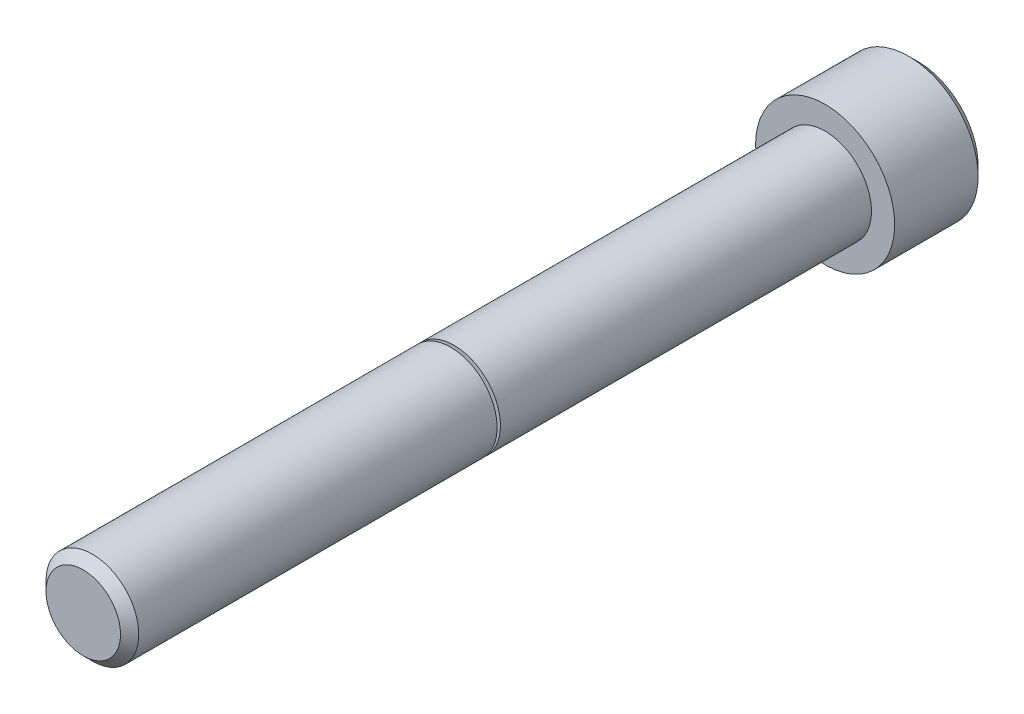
ISO-10303-21;
HEADER;
FILE_DESCRIPTION(('STEP AP214'),'2;1');
FILE_NAME('part.step','',(''),(''),'','','');
FILE_SCHEMA(('AUTOMOTIVE_DESIGN { 1 0 10303 214 1 1 1 1 }'));
ENDSEC;
DATA;
#1=APPLICATION_CONTEXT('core data for automotive mechanical design processes');
#2=APPLICATION_PROTOCOL_DEFINITION('international standard','automotive_design',2000,#1);
#3=PRODUCT_CONTEXT('',#1,'mechanical');
#4=PRODUCT('Part','Part','',(#3));
#5=PRODUCT_RELATED_PRODUCT_CATEGORY('part','',(#4));
#6=PRODUCT_DEFINITION_FORMATION('','',#4);
#7=PRODUCT_DEFINITION_CONTEXT('part definition',#1,'design');
#8=PRODUCT_DEFINITION('design','',#6,#7);
#9=PRODUCT_DEFINITION_SHAPE('','',#8);
#10=(LENGTH_UNIT() NAMED_UNIT(*) SI_UNIT(.MILLI.,.METRE.));
#11=(NAMED_UNIT(*) PLANE_ANGLE_UNIT() SI_UNIT($,.RADIAN.));
#12=(NAMED_UNIT(*) SI_UNIT($,.STERADIAN.) SOLID_ANGLE_UNIT());
#13=UNCERTAINTY_MEASURE_WITH_UNIT(LENGTH_MEASURE(1.E-05),#10,'distance_accuracy_value','');
#14=(GEOMETRIC_REPRESENTATION_CONTEXT(3) GLOBAL_UNCERTAINTY_ASSIGNED_CONTEXT((#13)) GLOBAL_UNIT_ASSIGNED_CONTEXT((#10,
#11,#12)) REPRESENTATION_CONTEXT('',''));
#15=CARTESIAN_POINT('',(0.,0.,0.));
#16=DIRECTION('',(0.,0.,1.));
#17=DIRECTION('',(1.,0.,0.));
#18=AXIS2_PLACEMENT_3D('',#15,#16,#17);
#19=CARTESIAN_POINT('',(0.,0.,-6.35));
#20=DIRECTION('',(0.,0.,1.));
#21=DIRECTION('',(1.,0.,0.));
#22=AXIS2_PLACEMENT_3D('',#19,#20,#21);
#23=PLANE('',#22);
#24=DIRECTION('',(-0.5,-0.866025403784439,0.));
#25=VECTOR('',#24,1.);
#26=CARTESIAN_POINT('',(2.74963065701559,0.,-6.35));
#27=LINE('',#26,#25);
#28=CARTESIAN_POINT('',(2.74963065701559,0.,-6.35));
#29=VERTEX_POINT('',#28);
#30=CARTESIAN_POINT('',(1.37481532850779,-2.38125000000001,-6.35));
#31=VERTEX_POINT('',#30);
#32=EDGE_CURVE('E145',#29,#31,#27,.T.);
#33=ORIENTED_EDGE('',*,*,#32,.F.);
#34=DIRECTION('',(0.499999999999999,-0.866025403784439,0.));
#35=VECTOR('',#34,1.);
#36=CARTESIAN_POINT('',(1.3748153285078,2.38125,-6.35));
#37=LINE('',#36,#35);
#38=CARTESIAN_POINT('',(1.3748153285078,2.38125,-6.35));
#39=VERTEX_POINT('',#38);
#40=EDGE_CURVE('E64',#39,#29,#37,.T.);
#41=ORIENTED_EDGE('',*,*,#40,.F.);
#42=DIRECTION('',(1.,0.,0.));
#43=VECTOR('',#42,1.);
#44=CARTESIAN_POINT('',(-1.3748153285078,2.38125,-6.35));
#45=LINE('',#44,#43);
#46=CARTESIAN_POINT('',(-1.3748153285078,2.38125,-6.35));
#47=VERTEX_POINT('',#46);
#48=EDGE_CURVE('E158',#47,#39,#45,.T.);
#49=ORIENTED_EDGE('',*,*,#48,.F.);
#50=DIRECTION('',(0.5,0.866025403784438,0.));
#51=VECTOR('',#50,1.);
#52=CARTESIAN_POINT('',(-2.74963065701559,0.,-6.35));
#53=LINE('',#52,#51);
#54=CARTESIAN_POINT('',(-2.74963065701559,0.,-6.35));
#55=VERTEX_POINT('',#54);
#56=EDGE_CURVE('E155',#55,#47,#53,.T.);
#57=ORIENTED_EDGE('',*,*,#56,.F.);
#58=DIRECTION('',(-0.5,0.866025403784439,0.));
#59=VECTOR('',#58,1.);
#60=CARTESIAN_POINT('',(-1.3748153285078,-2.38125000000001,-6.35));
#61=LINE('',#60,#59);
#62=CARTESIAN_POINT('',(-1.3748153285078,-2.38125000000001,-6.35));
#63=VERTEX_POINT('',#62);
#64=EDGE_CURVE('E112',#63,#55,#61,.T.);
#65=ORIENTED_EDGE('',*,*,#64,.F.);
#66=DIRECTION('',(-1.,0.,0.));
#67=VECTOR('',#66,1.);
#68=CARTESIAN_POINT('',(1.37481532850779,-2.38125000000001,-6.35));
#69=LINE('',#68,#67);
#70=EDGE_CURVE('E149',#31,#63,#69,.T.);
#71=ORIENTED_EDGE('',*,*,#70,.F.);
#72=EDGE_LOOP('',(#33,#41,#49,#57,#65,#71));
#73=FACE_BOUND('',#72,.T.);
#74=CARTESIAN_POINT('',(0.,0.,-6.35));
#75=DIRECTION('',(0.,0.,-1.));
#76=DIRECTION('',(-1.,0.,0.));
#77=AXIS2_PLACEMENT_3D('',#74,#75,#76);
#78=CIRCLE('',#77,4.1275);
#79=CARTESIAN_POINT('',(-4.1275,0.,-6.35));
#80=VERTEX_POINT('',#79);
#81=EDGE_CURVE('E164',#80,#80,#78,.T.);
#82=ORIENTED_EDGE('',*,*,#81,.T.);
#83=EDGE_LOOP('',(#82));
#84=FACE_BOUND('',#83,.T.);
#85=ADVANCED_FACE('F49',(#73,#84),#23,.F.);
#86=CARTESIAN_POINT('',(-2.55270000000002,0.,50.8));
#87=DIRECTION('',(0.,0.,-1.));
#88=DIRECTION('',(-1.,0.,0.));
#89=AXIS2_PLACEMENT_3D('',#86,#87,#88);
#90=PLANE('',#89);
#91=CARTESIAN_POINT('',(0.,0.,50.8));
#92=DIRECTION('',(0.,0.,-1.));
#93=DIRECTION('',(-1.,0.,0.));
#94=AXIS2_PLACEMENT_3D('',#91,#92,#93);
#95=CIRCLE('',#94,2.55270000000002);
#96=CARTESIAN_POINT('',(-2.55270000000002,0.,50.8));
#97=VERTEX_POINT('',#96);
#98=EDGE_CURVE('E11',#97,#97,#95,.T.);
#99=ORIENTED_EDGE('',*,*,#98,.F.);
#100=EDGE_LOOP('',(#99));
#101=FACE_BOUND('',#100,.T.);
#102=ADVANCED_FACE('F214',(#101),#90,.F.);
#103=CARTESIAN_POINT('',(0.,0.,50.8));
#104=DIRECTION('',(0.,0.,-1.));
#105=DIRECTION('',(-1.,0.,0.));
#106=AXIS2_PLACEMENT_3D('',#103,#104,#105);
#107=CONICAL_SURFACE('',#106,2.55270000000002,0.785398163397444);
#108=CARTESIAN_POINT('',(0.,0.,50.1777));
#109=DIRECTION('',(0.,0.,-1.));
#110=DIRECTION('',(-1.,0.,0.));
#111=AXIS2_PLACEMENT_3D('',#108,#109,#110);
#112=CIRCLE('',#111,3.17500000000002);
#113=CARTESIAN_POINT('',(-3.17500000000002,0.,50.1777));
#114=VERTEX_POINT('',#113);
#115=EDGE_CURVE('E57',#114,#114,#112,.T.);
#116=ORIENTED_EDGE('',*,*,#115,.F.);
#117=EDGE_LOOP('',(#116));
#118=FACE_BOUND('',#117,.T.);
#119=ORIENTED_EDGE('',*,*,#98,.T.);
#120=EDGE_LOOP('',(#119));
#121=FACE_BOUND('',#120,.T.);
#122=ADVANCED_FACE('F211',(#118,#121),#107,.T.);
#123=CARTESIAN_POINT('',(0.,0.,-10.585154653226));
#124=DIRECTION('',(0.,0.,-1.));
#125=DIRECTION('',(-1.,0.,0.));
#126=AXIS2_PLACEMENT_3D('',#123,#124,#125);
#127=CYLINDRICAL_SURFACE('',#126,3.17500000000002);
#128=CARTESIAN_POINT('',(0.,0.,25.6364986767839));
#129=DIRECTION('',(0.,0.,-1.));
#130=DIRECTION('',(-1.,0.,0.));
#131=AXIS2_PLACEMENT_3D('',#128,#129,#130);
#132=CIRCLE('',#131,3.17500000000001);
#133=CARTESIAN_POINT('',(-3.17500000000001,0.,25.6364986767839));
#134=VERTEX_POINT('',#133);
#135=EDGE_CURVE('E201',#134,#134,#132,.T.);
#136=ORIENTED_EDGE('',*,*,#135,.F.);
#137=EDGE_LOOP('',(#136));
#138=FACE_BOUND('',#137,.T.);
#139=ORIENTED_EDGE('',*,*,#115,.T.);
#140=EDGE_LOOP('',(#139));
#141=FACE_BOUND('',#140,.T.);
#142=ADVANCED_FACE('F209',(#138,#141),#127,.T.);
#143=CARTESIAN_POINT('',(0.,0.,25.6364986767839));
#144=DIRECTION('',(0.,0.,1.));
#145=DIRECTION('',(1.,0.,0.));
#146=AXIS2_PLACEMENT_3D('',#143,#144,#145);
#147=CONICAL_SURFACE('',#146,3.17500000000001,1.22173047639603);
#148=CARTESIAN_POINT('',(0.,0.,25.4487938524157));
#149=DIRECTION('',(0.,0.,-1.));
#150=DIRECTION('',(-1.,0.,0.));
#151=AXIS2_PLACEMENT_3D('',#148,#149,#150);
#152=CIRCLE('',#151,2.65928523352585);
#153=CARTESIAN_POINT('',(-2.65928523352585,0.,25.4487938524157));
#154=VERTEX_POINT('',#153);
#155=EDGE_CURVE('E197',#154,#154,#152,.T.);
#156=ORIENTED_EDGE('',*,*,#155,.F.);
#157=EDGE_LOOP('',(#156));
#158=FACE_BOUND('',#157,.T.);
#159=ORIENTED_EDGE('',*,*,#135,.T.);
#160=EDGE_LOOP('',(#159));
#161=FACE_BOUND('',#160,.T.);
#162=ADVANCED_FACE('F226',(#158,#161),#147,.T.);
#163=CARTESIAN_POINT('',(0.,0.,25.43));
#164=DIRECTION('',(0.,0.,-1.));
#165=DIRECTION('',(-1.,0.,0.));
#166=AXIS2_PLACEMENT_3D('',#163,#164,#165);
#167=TOROIDAL_SURFACE('',#166,2.66612563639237,0.0199999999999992);
#168=CARTESIAN_POINT('',(0.,0.,25.41));
#169=DIRECTION('',(0.,0.,-1.));
#170=DIRECTION('',(-1.,0.,0.));
#171=AXIS2_PLACEMENT_3D('',#168,#169,#170);
#172=CIRCLE('',#171,2.66612563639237);
#173=CARTESIAN_POINT('',(-2.66612563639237,0.,25.41));
#174=VERTEX_POINT('',#173);
#175=EDGE_CURVE('E193',#174,#174,#172,.T.);
#176=ORIENTED_EDGE('',*,*,#175,.F.);
#177=EDGE_LOOP('',(#176));
#178=FACE_BOUND('',#177,.T.);
#179=ORIENTED_EDGE('',*,*,#155,.T.);
#180=EDGE_LOOP('',(#179));
#181=FACE_BOUND('',#180,.T.);
#182=ADVANCED_FACE('F230',(#178,#181),#167,.F.);
#183=CARTESIAN_POINT('',(-3.17500000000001,0.,25.41));
#184=DIRECTION('',(0.,0.,-1.));
#185=DIRECTION('',(-1.,0.,0.));
#186=AXIS2_PLACEMENT_3D('',#183,#184,#185);
#187=PLANE('',#186);
#188=CARTESIAN_POINT('',(0.,0.,25.41));
#189=DIRECTION('',(0.,0.,-1.));
#190=DIRECTION('',(-1.,0.,0.));
#191=AXIS2_PLACEMENT_3D('',#188,#189,#190);
#192=CIRCLE('',#191,3.17500000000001);
#193=CARTESIAN_POINT('',(-3.17500000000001,0.,25.41));
#194=VERTEX_POINT('',#193);
#195=EDGE_CURVE('E189',#194,#194,#192,.T.);
#196=ORIENTED_EDGE('',*,*,#195,.F.);
#197=EDGE_LOOP('',(#196));
#198=FACE_BOUND('',#197,.T.);
#199=ORIENTED_EDGE('',*,*,#175,.T.);
#200=EDGE_LOOP('',(#199));
#201=FACE_BOUND('',#200,.T.);
#202=ADVANCED_FACE('F234',(#198,#201),#187,.F.);
#203=CARTESIAN_POINT('',(0.,0.,-10.585154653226));
#204=DIRECTION('',(0.,0.,-1.));
#205=DIRECTION('',(-1.,0.,0.));
#206=AXIS2_PLACEMENT_3D('',#203,#204,#205);
#207=CYLINDRICAL_SURFACE('',#206,3.17500000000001);
#208=CARTESIAN_POINT('',(0.,0.,0.));
#209=DIRECTION('',(0.,0.,-1.));
#210=DIRECTION('',(-1.,0.,0.));
#211=AXIS2_PLACEMENT_3D('',#208,#209,#210);
#212=CIRCLE('',#211,3.175);
#213=CARTESIAN_POINT('',(-3.175,0.,0.));
#214=VERTEX_POINT('',#213);
#215=EDGE_CURVE('E185',#214,#214,#212,.T.);
#216=ORIENTED_EDGE('',*,*,#215,.F.);
#217=EDGE_LOOP('',(#216));
#218=FACE_BOUND('',#217,.T.);
#219=ORIENTED_EDGE('',*,*,#195,.T.);
#220=EDGE_LOOP('',(#219));
#221=FACE_BOUND('',#220,.T.);
#222=ADVANCED_FACE('F238',(#218,#221),#207,.T.);
#223=CARTESIAN_POINT('',(-4.7625,0.,0.));
#224=DIRECTION('',(0.,0.,-1.));
#225=DIRECTION('',(-1.,0.,0.));
#226=AXIS2_PLACEMENT_3D('',#223,#224,#225);
#227=PLANE('',#226);
#228=CARTESIAN_POINT('',(0.,0.,0.));
#229=DIRECTION('',(0.,0.,-1.));
#230=DIRECTION('',(-1.,0.,0.));
#231=AXIS2_PLACEMENT_3D('',#228,#229,#230);
#232=CIRCLE('',#231,4.7625);
#233=CARTESIAN_POINT('',(-4.7625,0.,0.));
#234=VERTEX_POINT('',#233);
#235=EDGE_CURVE('E181',#234,#234,#232,.T.);
#236=ORIENTED_EDGE('',*,*,#235,.F.);
#237=EDGE_LOOP('',(#236));
#238=FACE_BOUND('',#237,.T.);
#239=ORIENTED_EDGE('',*,*,#215,.T.);
#240=EDGE_LOOP('',(#239));
#241=FACE_BOUND('',#240,.T.);
#242=ADVANCED_FACE('F242',(#238,#241),#227,.F.);
#243=CARTESIAN_POINT('',(0.,0.,-10.585154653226));
#244=DIRECTION('',(0.,0.,-1.));
#245=DIRECTION('',(-1.,0.,0.));
#246=AXIS2_PLACEMENT_3D('',#243,#244,#245);
#247=CYLINDRICAL_SURFACE('',#246,4.7625);
#248=CARTESIAN_POINT('',(0.,0.,-5.715));
#249=DIRECTION('',(0.,0.,-1.));
#250=DIRECTION('',(-1.,0.,0.));
#251=AXIS2_PLACEMENT_3D('',#248,#249,#250);
#252=CIRCLE('',#251,4.7625);
#253=CARTESIAN_POINT('',(-4.7625,0.,-5.715));
#254=VERTEX_POINT('',#253);
#255=EDGE_CURVE('E177',#254,#254,#252,.T.);
#256=ORIENTED_EDGE('',*,*,#255,.F.);
#257=EDGE_LOOP('',(#256));
#258=FACE_BOUND('',#257,.T.);
#259=ORIENTED_EDGE('',*,*,#235,.T.);
#260=EDGE_LOOP('',(#259));
#261=FACE_BOUND('',#260,.T.);
#262=ADVANCED_FACE('F246',(#258,#261),#247,.T.);
#263=CARTESIAN_POINT('',(0.,0.,-5.715));
#264=DIRECTION('',(0.,0.,1.));
#265=DIRECTION('',(1.,0.,0.));
#266=AXIS2_PLACEMENT_3D('',#263,#264,#265);
#267=CONICAL_SURFACE('',#266,4.7625,0.785398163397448);
#268=ORIENTED_EDGE('',*,*,#81,.F.);
#269=EDGE_LOOP('',(#268));
#270=FACE_BOUND('',#269,.T.);
#271=ORIENTED_EDGE('',*,*,#255,.T.);
#272=EDGE_LOOP('',(#271));
#273=FACE_BOUND('',#272,.T.);
#274=ADVANCED_FACE('F250',(#270,#273),#267,.T.);
#275=CARTESIAN_POINT('',(1.3748153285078,2.38125,-3.175));
#276=DIRECTION('',(0.866025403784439,0.499999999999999,0.));
#277=DIRECTION('',(-0.5,0.866025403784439,0.));
#278=AXIS2_PLACEMENT_3D('',#275,#276,#277);
#279=PLANE('',#278);
#280=ORIENTED_EDGE('',*,*,#40,.T.);
#281=DIRECTION('',(0.,0.,-1.));
#282=VECTOR('',#281,1.);
#283=CARTESIAN_POINT('',(2.74963065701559,0.,-3.175));
#284=LINE('',#283,#282);
#285=CARTESIAN_POINT('',(2.74963065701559,0.,-3.175));
#286=VERTEX_POINT('',#285);
#287=EDGE_CURVE('E94',#286,#29,#284,.T.);
#288=ORIENTED_EDGE('',*,*,#287,.F.);
#289=DIRECTION('',(0.499999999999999,-0.866025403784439,0.));
#290=VECTOR('',#289,1.);
#291=CARTESIAN_POINT('',(1.3748153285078,2.38125,-3.175));
#292=LINE('',#291,#290);
#293=CARTESIAN_POINT('',(1.3748153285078,2.38125,-3.175));
#294=VERTEX_POINT('',#293);
#295=EDGE_CURVE('E161',#294,#286,#292,.T.);
#296=ORIENTED_EDGE('',*,*,#295,.F.);
#297=DIRECTION('',(0.,0.,-1.));
#298=VECTOR('',#297,1.);
#299=CARTESIAN_POINT('',(1.3748153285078,2.38125,-3.175));
#300=LINE('',#299,#298);
#301=EDGE_CURVE('E72',#294,#39,#300,.T.);
#302=ORIENTED_EDGE('',*,*,#301,.T.);
#303=EDGE_LOOP('',(#280,#288,#296,#302));
#304=FACE_BOUND('',#303,.T.);
#305=ADVANCED_FACE('F254',(#304),#279,.F.);
#306=CARTESIAN_POINT('',(-1.3748153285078,2.38125,-3.175));
#307=DIRECTION('',(0.,1.,0.));
#308=DIRECTION('',(-1.,0.,0.));
#309=AXIS2_PLACEMENT_3D('',#306,#307,#308);
#310=PLANE('',#309);
#311=ORIENTED_EDGE('',*,*,#48,.T.);
#312=ORIENTED_EDGE('',*,*,#301,.F.);
#313=DIRECTION('',(1.,0.,0.));
#314=VECTOR('',#313,1.);
#315=CARTESIAN_POINT('',(-1.3748153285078,2.38125,-3.175));
#316=LINE('',#315,#314);
#317=CARTESIAN_POINT('',(-1.3748153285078,2.38125,-3.175));
#318=VERTEX_POINT('',#317);
#319=EDGE_CURVE('E126',#318,#294,#316,.T.);
#320=ORIENTED_EDGE('',*,*,#319,.F.);
#321=DIRECTION('',(0.,0.,-1.));
#322=VECTOR('',#321,1.);
#323=CARTESIAN_POINT('',(-1.3748153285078,2.38125,-3.175));
#324=LINE('',#323,#322);
#325=EDGE_CURVE('E117',#318,#47,#324,.T.);
#326=ORIENTED_EDGE('',*,*,#325,.T.);
#327=EDGE_LOOP('',(#311,#312,#320,#326));
#328=FACE_BOUND('',#327,.T.);
#329=ADVANCED_FACE('F258',(#328),#310,.F.);
#330=CARTESIAN_POINT('',(-2.74963065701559,0.,-3.175));
#331=DIRECTION('',(-0.866025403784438,0.5,0.));
#332=DIRECTION('',(-0.5,-0.866025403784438,0.));
#333=AXIS2_PLACEMENT_3D('',#330,#331,#332);
#334=PLANE('',#333);
#335=ORIENTED_EDGE('',*,*,#56,.T.);
#336=ORIENTED_EDGE('',*,*,#325,.F.);
#337=DIRECTION('',(0.5,0.866025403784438,0.));
#338=VECTOR('',#337,1.);
#339=CARTESIAN_POINT('',(-2.74963065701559,0.,-3.175));
#340=LINE('',#339,#338);
#341=CARTESIAN_POINT('',(-2.74963065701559,0.,-3.175));
#342=VERTEX_POINT('',#341);
#343=EDGE_CURVE('E121',#342,#318,#340,.T.);
#344=ORIENTED_EDGE('',*,*,#343,.F.);
#345=DIRECTION('',(0.,0.,-1.));
#346=VECTOR('',#345,1.);
#347=CARTESIAN_POINT('',(-2.74963065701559,0.,-3.175));
#348=LINE('',#347,#346);
#349=EDGE_CURVE('E105',#342,#55,#348,.T.);
#350=ORIENTED_EDGE('',*,*,#349,.T.);
#351=EDGE_LOOP('',(#335,#336,#344,#350));
#352=FACE_BOUND('',#351,.T.);
#353=ADVANCED_FACE('F122',(#352),#334,.F.);
#354=CARTESIAN_POINT('',(-1.3748153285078,-2.38125000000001,-3.175));
#355=DIRECTION('',(-0.866025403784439,-0.5,0.));
#356=DIRECTION('',(0.5,-0.866025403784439,0.));
#357=AXIS2_PLACEMENT_3D('',#354,#355,#356);
#358=PLANE('',#357);
#359=ORIENTED_EDGE('',*,*,#64,.T.);
#360=ORIENTED_EDGE('',*,*,#349,.F.);
#361=DIRECTION('',(-0.5,0.866025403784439,0.));
#362=VECTOR('',#361,1.);
#363=CARTESIAN_POINT('',(-1.3748153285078,-2.38125000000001,-3.175));
#364=LINE('',#363,#362);
#365=CARTESIAN_POINT('',(-1.3748153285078,-2.38125000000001,-3.175));
#366=VERTEX_POINT('',#365);
#367=EDGE_CURVE('E109',#366,#342,#364,.T.);
#368=ORIENTED_EDGE('',*,*,#367,.F.);
#369=DIRECTION('',(0.,0.,-1.));
#370=VECTOR('',#369,1.);
#371=CARTESIAN_POINT('',(-1.3748153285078,-2.38125000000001,-3.175));
#372=LINE('',#371,#370);
#373=EDGE_CURVE('E118',#366,#63,#372,.T.);
#374=ORIENTED_EDGE('',*,*,#373,.T.);
#375=EDGE_LOOP('',(#359,#360,#368,#374));
#376=FACE_BOUND('',#375,.T.);
#377=ADVANCED_FACE('F107',(#376),#358,.F.);
#378=CARTESIAN_POINT('',(1.37481532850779,-2.38125000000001,-3.175));
#379=DIRECTION('',(0.,-1.,0.));
#380=DIRECTION('',(0.,0.,-1.));
#381=AXIS2_PLACEMENT_3D('',#378,#379,#380);
#382=PLANE('',#381);
#383=ORIENTED_EDGE('',*,*,#70,.T.);
#384=ORIENTED_EDGE('',*,*,#373,.F.);
#385=DIRECTION('',(-1.,0.,0.));
#386=VECTOR('',#385,1.);
#387=CARTESIAN_POINT('',(1.37481532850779,-2.38125000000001,-3.175));
#388=LINE('',#387,#386);
#389=CARTESIAN_POINT('',(1.37481532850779,-2.38125000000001,-3.175));
#390=VERTEX_POINT('',#389);
#391=EDGE_CURVE('E132',#390,#366,#388,.T.);
#392=ORIENTED_EDGE('',*,*,#391,.F.);
#393=DIRECTION('',(0.,0.,-1.));
#394=VECTOR('',#393,1.);
#395=CARTESIAN_POINT('',(1.37481532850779,-2.38125000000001,-3.175));
#396=LINE('',#395,#394);
#397=EDGE_CURVE('E169',#390,#31,#396,.T.);
#398=ORIENTED_EDGE('',*,*,#397,.T.);
#399=EDGE_LOOP('',(#383,#384,#392,#398));
#400=FACE_BOUND('',#399,.T.);
#401=ADVANCED_FACE('F262',(#400),#382,.F.);
#402=CARTESIAN_POINT('',(2.74963065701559,0.,-3.175));
#403=DIRECTION('',(0.866025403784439,-0.5,0.));
#404=DIRECTION('',(0.5,0.866025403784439,0.));
#405=AXIS2_PLACEMENT_3D('',#402,#403,#404);
#406=PLANE('',#405);
#407=ORIENTED_EDGE('',*,*,#32,.T.);
#408=ORIENTED_EDGE('',*,*,#397,.F.);
#409=DIRECTION('',(-0.5,-0.866025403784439,0.));
#410=VECTOR('',#409,1.);
#411=CARTESIAN_POINT('',(2.74963065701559,0.,-3.175));
#412=LINE('',#411,#410);
#413=EDGE_CURVE('E137',#286,#390,#412,.T.);
#414=ORIENTED_EDGE('',*,*,#413,.F.);
#415=ORIENTED_EDGE('',*,*,#287,.T.);
#416=EDGE_LOOP('',(#407,#408,#414,#415));
#417=FACE_BOUND('',#416,.T.);
#418=ADVANCED_FACE('F259',(#417),#406,.F.);
#419=CARTESIAN_POINT('',(1.3748153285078,2.38125,-3.175));
#420=DIRECTION('',(0.,0.,1.));
#421=DIRECTION('',(1.,0.,0.));
#422=AXIS2_PLACEMENT_3D('',#419,#420,#421);
#423=PLANE('',#422);
#424=ORIENTED_EDGE('',*,*,#295,.T.);
#425=ORIENTED_EDGE('',*,*,#413,.T.);
#426=ORIENTED_EDGE('',*,*,#391,.T.);
#427=ORIENTED_EDGE('',*,*,#367,.T.);
#428=ORIENTED_EDGE('',*,*,#343,.T.);
#429=ORIENTED_EDGE('',*,*,#319,.T.);
#430=EDGE_LOOP('',(#424,#425,#426,#427,#428,#429));
#431=FACE_BOUND('',#430,.T.);
#432=ADVANCED_FACE('F129',(#431),#423,.F.);
#433=CLOSED_SHELL('',(#85,#102,#122,#142,#162,#182,#202,#222,#242,#262,#274,#305,#329,#353,#377,
#401,#418,#432));
#434=MANIFOLD_SOLID_BREP('B2',#433);
#435=ADVANCED_BREP_SHAPE_REPRESENTATION('',(#18,#434),#14);
#436=SHAPE_DEFINITION_REPRESENTATION(#9,#435);
ENDSEC;
END-ISO-10303-21;
